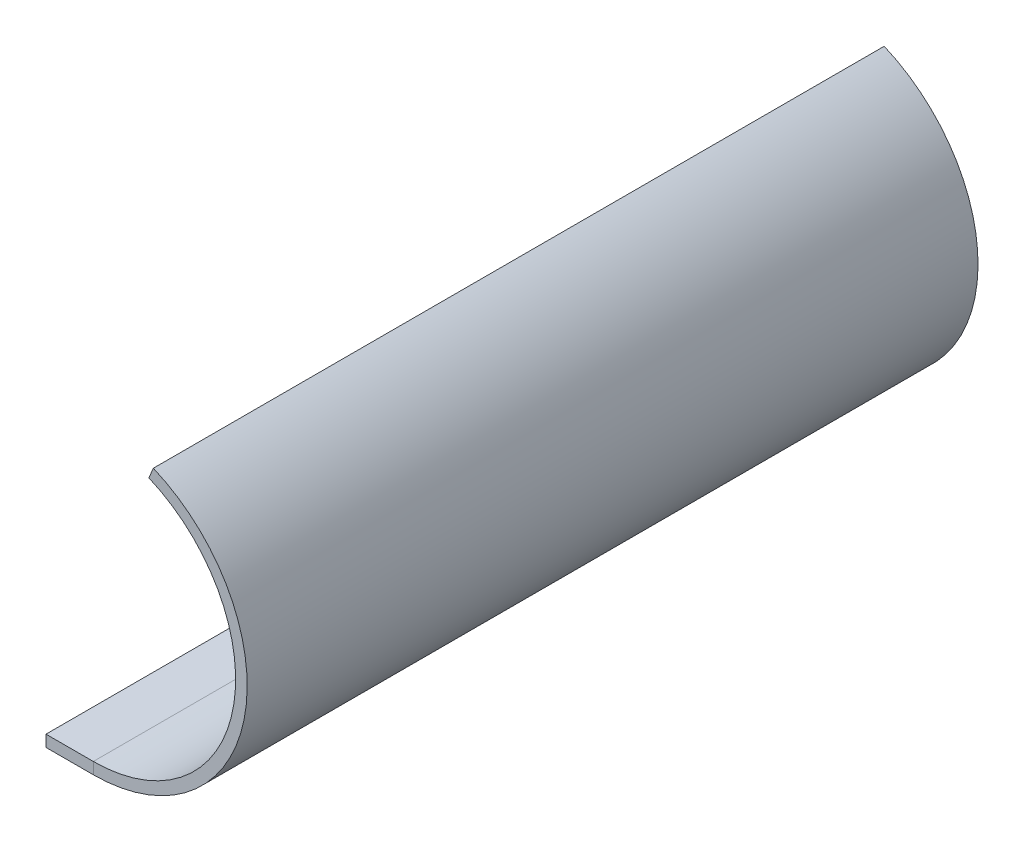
ISO-10303-21;
HEADER;
FILE_DESCRIPTION(('STEP AP214'),'2;1');
FILE_NAME('part.step','',(''),(''),'','','');
FILE_SCHEMA(('AUTOMOTIVE_DESIGN { 1 0 10303 214 1 1 1 1 }'));
ENDSEC;
DATA;
#1=APPLICATION_CONTEXT('core data for automotive mechanical design processes');
#2=APPLICATION_PROTOCOL_DEFINITION('international standard','automotive_design',2000,#1);
#3=PRODUCT_CONTEXT('',#1,'mechanical');
#4=PRODUCT('Part','Part','',(#3));
#5=PRODUCT_RELATED_PRODUCT_CATEGORY('part','',(#4));
#6=PRODUCT_DEFINITION_FORMATION('','',#4);
#7=PRODUCT_DEFINITION_CONTEXT('part definition',#1,'design');
#8=PRODUCT_DEFINITION('design','',#6,#7);
#9=PRODUCT_DEFINITION_SHAPE('','',#8);
#10=(LENGTH_UNIT() NAMED_UNIT(*) SI_UNIT(.MILLI.,.METRE.));
#11=(NAMED_UNIT(*) PLANE_ANGLE_UNIT() SI_UNIT($,.RADIAN.));
#12=(NAMED_UNIT(*) SI_UNIT($,.STERADIAN.) SOLID_ANGLE_UNIT());
#13=UNCERTAINTY_MEASURE_WITH_UNIT(LENGTH_MEASURE(1.E-05),#10,'distance_accuracy_value','');
#14=(GEOMETRIC_REPRESENTATION_CONTEXT(3) GLOBAL_UNCERTAINTY_ASSIGNED_CONTEXT((#13)) GLOBAL_UNIT_ASSIGNED_CONTEXT((#10,
#11,#12)) REPRESENTATION_CONTEXT('',''));
#15=CARTESIAN_POINT('',(0.,0.,0.));
#16=DIRECTION('',(0.,0.,1.));
#17=DIRECTION('',(1.,0.,0.));
#18=AXIS2_PLACEMENT_3D('',#15,#16,#17);
#19=CARTESIAN_POINT('',(0.,-40.,190.));
#20=DIRECTION('',(0.,0.,1.));
#21=DIRECTION('',(1.,0.,0.));
#22=AXIS2_PLACEMENT_3D('',#19,#20,#21);
#23=PLANE('',#22);
#24=DIRECTION('',(0.,1.,0.));
#25=VECTOR('',#24,1.);
#26=CARTESIAN_POINT('',(0.,-40.,190.));
#27=LINE('',#26,#25);
#28=CARTESIAN_POINT('',(0.,-40.,190.));
#29=VERTEX_POINT('',#28);
#30=CARTESIAN_POINT('',(0.,-37.,190.));
#31=VERTEX_POINT('',#30);
#32=EDGE_CURVE('E11',#29,#31,#27,.T.);
#33=ORIENTED_EDGE('',*,*,#32,.F.);
#34=CARTESIAN_POINT('',(0.,0.,190.));
#35=DIRECTION('',(0.,0.,1.));
#36=DIRECTION('',(1.,0.,0.));
#37=AXIS2_PLACEMENT_3D('',#34,#35,#36);
#38=CIRCLE('',#37,40.);
#39=CARTESIAN_POINT('',(15.6102695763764,36.8282430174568,190.));
#40=VERTEX_POINT('',#39);
#41=EDGE_CURVE('E85',#29,#40,#38,.T.);
#42=ORIENTED_EDGE('',*,*,#41,.T.);
#43=DIRECTION('',(0.39025673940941,0.92070607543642,0.));
#44=VECTOR('',#43,1.);
#45=CARTESIAN_POINT('',(14.4394993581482,34.0661247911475,190.));
#46=LINE('',#45,#44);
#47=CARTESIAN_POINT('',(14.4394993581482,34.0661247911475,190.));
#48=VERTEX_POINT('',#47);
#49=EDGE_CURVE('E146',#48,#40,#46,.T.);
#50=ORIENTED_EDGE('',*,*,#49,.F.);
#51=CARTESIAN_POINT('',(0.,0.,190.));
#52=DIRECTION('',(0.,0.,1.));
#53=DIRECTION('',(1.,0.,0.));
#54=AXIS2_PLACEMENT_3D('',#51,#52,#53);
#55=CIRCLE('',#54,37.);
#56=EDGE_CURVE('E112',#31,#48,#55,.T.);
#57=ORIENTED_EDGE('',*,*,#56,.F.);
#58=EDGE_LOOP('',(#33,#42,#50,#57));
#59=FACE_BOUND('',#58,.T.);
#60=ADVANCED_FACE('F38',(#59),#23,.T.);
#61=CARTESIAN_POINT('',(0.,-37.,0.));
#62=DIRECTION('',(0.,0.,-1.));
#63=DIRECTION('',(-1.,0.,0.));
#64=AXIS2_PLACEMENT_3D('',#61,#62,#63);
#65=PLANE('',#64);
#66=DIRECTION('',(0.,-1.,0.));
#67=VECTOR('',#66,1.);
#68=CARTESIAN_POINT('',(0.,-37.,0.));
#69=LINE('',#68,#67);
#70=CARTESIAN_POINT('',(0.,-37.,0.));
#71=VERTEX_POINT('',#70);
#72=CARTESIAN_POINT('',(0.,-40.,0.));
#73=VERTEX_POINT('',#72);
#74=EDGE_CURVE('E46',#71,#73,#69,.T.);
#75=ORIENTED_EDGE('',*,*,#74,.F.);
#76=CARTESIAN_POINT('',(0.,0.,0.));
#77=DIRECTION('',(0.,0.,1.));
#78=DIRECTION('',(1.,0.,0.));
#79=AXIS2_PLACEMENT_3D('',#76,#77,#78);
#80=CIRCLE('',#79,37.);
#81=CARTESIAN_POINT('',(14.4394993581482,34.0661247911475,0.));
#82=VERTEX_POINT('',#81);
#83=EDGE_CURVE('E127',#71,#82,#80,.T.);
#84=ORIENTED_EDGE('',*,*,#83,.T.);
#85=DIRECTION('',(0.39025673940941,0.92070607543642,0.));
#86=VECTOR('',#85,1.);
#87=CARTESIAN_POINT('',(14.4394993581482,34.0661247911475,0.));
#88=LINE('',#87,#86);
#89=CARTESIAN_POINT('',(15.6102695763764,36.8282430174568,0.));
#90=VERTEX_POINT('',#89);
#91=EDGE_CURVE('E124',#82,#90,#88,.T.);
#92=ORIENTED_EDGE('',*,*,#91,.T.);
#93=CARTESIAN_POINT('',(0.,0.,0.));
#94=DIRECTION('',(0.,0.,1.));
#95=DIRECTION('',(1.,0.,0.));
#96=AXIS2_PLACEMENT_3D('',#93,#94,#95);
#97=CIRCLE('',#96,40.);
#98=EDGE_CURVE('E121',#73,#90,#97,.T.);
#99=ORIENTED_EDGE('',*,*,#98,.F.);
#100=EDGE_LOOP('',(#75,#84,#92,#99));
#101=FACE_BOUND('',#100,.T.);
#102=ADVANCED_FACE('F152',(#101),#65,.T.);
#103=CARTESIAN_POINT('',(0.,0.,190.));
#104=DIRECTION('',(0.,0.,-1.));
#105=DIRECTION('',(-1.,0.,0.));
#106=AXIS2_PLACEMENT_3D('',#103,#104,#105);
#107=CYLINDRICAL_SURFACE('',#106,40.);
#108=ORIENTED_EDGE('',*,*,#98,.T.);
#109=DIRECTION('',(0.,0.,-1.));
#110=VECTOR('',#109,1.);
#111=CARTESIAN_POINT('',(15.6102695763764,36.8282430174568,190.));
#112=LINE('',#111,#110);
#113=EDGE_CURVE('E141',#40,#90,#112,.T.);
#114=ORIENTED_EDGE('',*,*,#113,.F.);
#115=ORIENTED_EDGE('',*,*,#41,.F.);
#116=DIRECTION('',(0.,0.,-1.));
#117=VECTOR('',#116,1.);
#118=CARTESIAN_POINT('',(0.,-40.,190.));
#119=LINE('',#118,#117);
#120=EDGE_CURVE('E117',#29,#73,#119,.T.);
#121=ORIENTED_EDGE('',*,*,#120,.T.);
#122=EDGE_LOOP('',(#108,#114,#115,#121));
#123=FACE_BOUND('',#122,.T.);
#124=ADVANCED_FACE('F149',(#123),#107,.T.);
#125=CARTESIAN_POINT('',(14.4394993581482,34.0661247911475,190.));
#126=DIRECTION('',(-0.92070607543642,0.39025673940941,0.));
#127=DIRECTION('',(-0.39025673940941,-0.920706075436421,0.));
#128=AXIS2_PLACEMENT_3D('',#125,#126,#127);
#129=PLANE('',#128);
#130=ORIENTED_EDGE('',*,*,#91,.F.);
#131=DIRECTION('',(0.,0.,-1.));
#132=VECTOR('',#131,1.);
#133=CARTESIAN_POINT('',(14.4394993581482,34.0661247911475,190.));
#134=LINE('',#133,#132);
#135=EDGE_CURVE('E139',#48,#82,#134,.T.);
#136=ORIENTED_EDGE('',*,*,#135,.F.);
#137=ORIENTED_EDGE('',*,*,#49,.T.);
#138=ORIENTED_EDGE('',*,*,#113,.T.);
#139=EDGE_LOOP('',(#130,#136,#137,#138));
#140=FACE_BOUND('',#139,.T.);
#141=ADVANCED_FACE('F145',(#140),#129,.T.);
#142=CARTESIAN_POINT('',(0.,0.,190.));
#143=DIRECTION('',(0.,0.,-1.));
#144=DIRECTION('',(-1.,0.,0.));
#145=AXIS2_PLACEMENT_3D('',#142,#143,#144);
#146=CYLINDRICAL_SURFACE('',#145,37.);
#147=ORIENTED_EDGE('',*,*,#83,.F.);
#148=DIRECTION('',(0.,0.,-1.));
#149=VECTOR('',#148,1.);
#150=CARTESIAN_POINT('',(0.,-37.,190.));
#151=LINE('',#150,#149);
#152=EDGE_CURVE('E105',#31,#71,#151,.T.);
#153=ORIENTED_EDGE('',*,*,#152,.F.);
#154=ORIENTED_EDGE('',*,*,#56,.T.);
#155=ORIENTED_EDGE('',*,*,#135,.T.);
#156=EDGE_LOOP('',(#147,#153,#154,#155));
#157=FACE_BOUND('',#156,.T.);
#158=ADVANCED_FACE('F155',(#157),#146,.F.);
#159=CARTESIAN_POINT('',(-12.3,-37.,190.));
#160=DIRECTION('',(0.,1.,0.));
#161=DIRECTION('',(0.,0.,1.));
#162=AXIS2_PLACEMENT_3D('',#159,#160,#161);
#163=PLANE('',#162);
#164=DIRECTION('',(1.,0.,0.));
#165=VECTOR('',#164,1.);
#166=CARTESIAN_POINT('',(-12.3,-37.,0.));
#167=LINE('',#166,#165);
#168=CARTESIAN_POINT('',(-12.3,-37.,0.));
#169=VERTEX_POINT('',#168);
#170=EDGE_CURVE('E100',#169,#71,#167,.T.);
#171=ORIENTED_EDGE('',*,*,#170,.F.);
#172=DIRECTION('',(0.,0.,-1.));
#173=VECTOR('',#172,1.);
#174=CARTESIAN_POINT('',(-12.3,-37.,190.));
#175=LINE('',#174,#173);
#176=CARTESIAN_POINT('',(-12.3,-37.,190.));
#177=VERTEX_POINT('',#176);
#178=EDGE_CURVE('E95',#177,#169,#175,.T.);
#179=ORIENTED_EDGE('',*,*,#178,.F.);
#180=DIRECTION('',(1.,0.,0.));
#181=VECTOR('',#180,1.);
#182=CARTESIAN_POINT('',(-12.3,-37.,190.));
#183=LINE('',#182,#181);
#184=EDGE_CURVE('E99',#177,#31,#183,.T.);
#185=ORIENTED_EDGE('',*,*,#184,.T.);
#186=ORIENTED_EDGE('',*,*,#152,.T.);
#187=EDGE_LOOP('',(#171,#179,#185,#186));
#188=FACE_BOUND('',#187,.T.);
#189=ADVANCED_FACE('F97',(#188),#163,.T.);
#190=CARTESIAN_POINT('',(-12.3,-40.,190.));
#191=DIRECTION('',(-1.,0.,0.));
#192=DIRECTION('',(0.,0.,1.));
#193=AXIS2_PLACEMENT_3D('',#190,#191,#192);
#194=PLANE('',#193);
#195=DIRECTION('',(0.,1.,0.));
#196=VECTOR('',#195,1.);
#197=CARTESIAN_POINT('',(-12.3,-40.,0.));
#198=LINE('',#197,#196);
#199=CARTESIAN_POINT('',(-12.3,-40.,0.));
#200=VERTEX_POINT('',#199);
#201=EDGE_CURVE('E131',#200,#169,#198,.T.);
#202=ORIENTED_EDGE('',*,*,#201,.F.);
#203=DIRECTION('',(0.,0.,-1.));
#204=VECTOR('',#203,1.);
#205=CARTESIAN_POINT('',(-12.3,-40.,190.));
#206=LINE('',#205,#204);
#207=CARTESIAN_POINT('',(-12.3,-40.,190.));
#208=VERTEX_POINT('',#207);
#209=EDGE_CURVE('E75',#208,#200,#206,.T.);
#210=ORIENTED_EDGE('',*,*,#209,.F.);
#211=DIRECTION('',(0.,1.,0.));
#212=VECTOR('',#211,1.);
#213=CARTESIAN_POINT('',(-12.3,-40.,190.));
#214=LINE('',#213,#212);
#215=EDGE_CURVE('E110',#208,#177,#214,.T.);
#216=ORIENTED_EDGE('',*,*,#215,.T.);
#217=ORIENTED_EDGE('',*,*,#178,.T.);
#218=EDGE_LOOP('',(#202,#210,#216,#217));
#219=FACE_BOUND('',#218,.T.);
#220=ADVANCED_FACE('F114',(#219),#194,.T.);
#221=CARTESIAN_POINT('',(-12.3,-40.,190.));
#222=DIRECTION('',(0.,1.,0.));
#223=DIRECTION('',(0.,0.,1.));
#224=AXIS2_PLACEMENT_3D('',#221,#222,#223);
#225=PLANE('',#224);
#226=DIRECTION('',(1.,0.,0.));
#227=VECTOR('',#226,1.);
#228=CARTESIAN_POINT('',(-12.3,-40.,0.));
#229=LINE('',#228,#227);
#230=EDGE_CURVE('E133',#200,#73,#229,.T.);
#231=ORIENTED_EDGE('',*,*,#230,.T.);
#232=ORIENTED_EDGE('',*,*,#120,.F.);
#233=DIRECTION('',(1.,0.,0.));
#234=VECTOR('',#233,1.);
#235=CARTESIAN_POINT('',(-12.3,-40.,190.));
#236=LINE('',#235,#234);
#237=EDGE_CURVE('E115',#208,#29,#236,.T.);
#238=ORIENTED_EDGE('',*,*,#237,.F.);
#239=ORIENTED_EDGE('',*,*,#209,.T.);
#240=EDGE_LOOP('',(#231,#232,#238,#239));
#241=FACE_BOUND('',#240,.T.);
#242=ADVANCED_FACE('F158',(#241),#225,.F.);
#243=CARTESIAN_POINT('',(0.,0.,190.));
#244=DIRECTION('',(0.,0.,1.));
#245=DIRECTION('',(1.,0.,0.));
#246=AXIS2_PLACEMENT_3D('',#243,#244,#245);
#247=PLANE('',#246);
#248=ORIENTED_EDGE('',*,*,#237,.T.);
#249=ORIENTED_EDGE('',*,*,#32,.T.);
#250=ORIENTED_EDGE('',*,*,#184,.F.);
#251=ORIENTED_EDGE('',*,*,#215,.F.);
#252=EDGE_LOOP('',(#248,#249,#250,#251));
#253=FACE_BOUND('',#252,.T.);
#254=ADVANCED_FACE('F109',(#253),#247,.T.);
#255=CARTESIAN_POINT('',(0.,0.,0.));
#256=DIRECTION('',(0.,0.,1.));
#257=DIRECTION('',(1.,0.,0.));
#258=AXIS2_PLACEMENT_3D('',#255,#256,#257);
#259=PLANE('',#258);
#260=ORIENTED_EDGE('',*,*,#170,.T.);
#261=ORIENTED_EDGE('',*,*,#74,.T.);
#262=ORIENTED_EDGE('',*,*,#230,.F.);
#263=ORIENTED_EDGE('',*,*,#201,.T.);
#264=EDGE_LOOP('',(#260,#261,#262,#263));
#265=FACE_BOUND('',#264,.T.);
#266=ADVANCED_FACE('F157',(#265),#259,.F.);
#267=CLOSED_SHELL('',(#60,#102,#124,#141,#158,#189,#220,#242,#254,#266));
#268=MANIFOLD_SOLID_BREP('B2',#267);
#269=ADVANCED_BREP_SHAPE_REPRESENTATION('',(#18,#268),#14);
#270=SHAPE_DEFINITION_REPRESENTATION(#9,#269);
ENDSEC;
END-ISO-10303-21;
